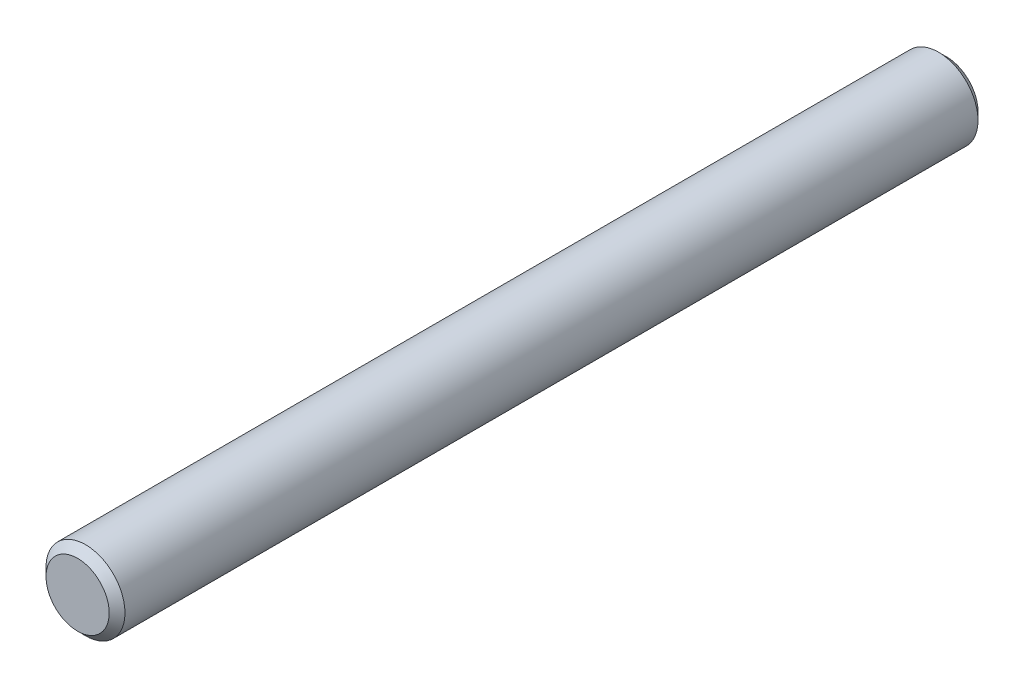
from build123d import *

# Parameters (mm, degrees)
ESQUISSE1_R          = 5
BASE_EXTRUSION_DEPTH = 110
CHANFREIN1_SIZE      = 1


with BuildPart() as part:
    # Esquisse1 → Base-Extrusion (new body)
    with BuildSketch(Plane.XY):
        Circle(ESQUISSE1_R)
    extrude(amount=BASE_EXTRUSION_DEPTH)

    # Chanfrein1
    chanfrein1_edges = [part.edges().sort_by_distance(p)[0] for p in [
        (-5, 0, 0),
        (-5, 0, 110),
    ]]
    chamfer(chanfrein1_edges, length=CHANFREIN1_SIZE)


solid = part.part
